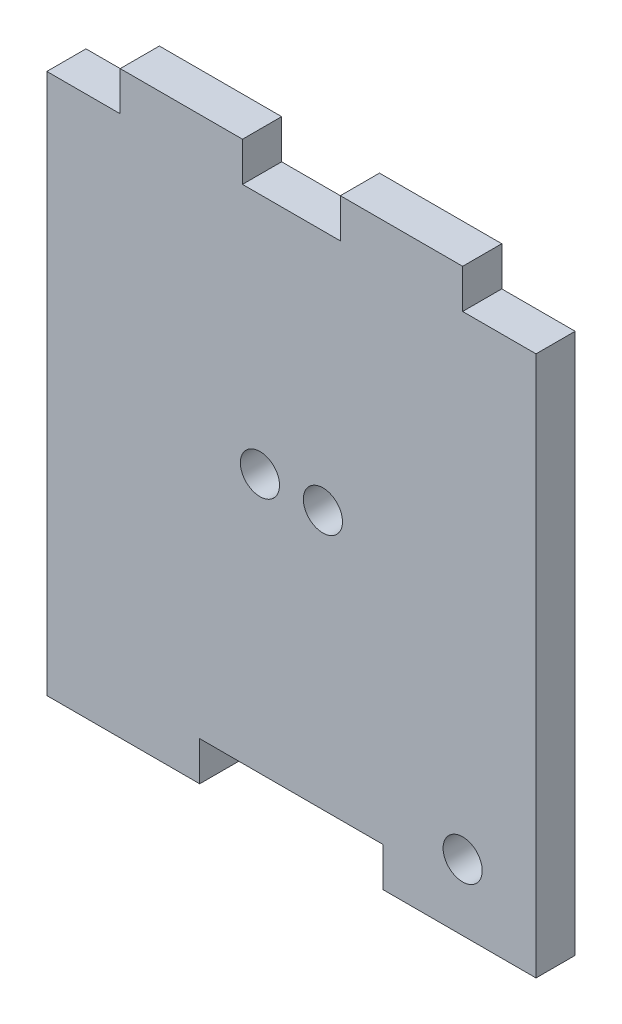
from build123d import *

# Parameters (mm, degrees)
SKETCH1_W           = 50
SKETCH1_H           = 16
SKETCH1_R           = 8
BOSS_EXTRUDE1_DEPTH = 16


with BuildPart() as part:
    # Sketch1 → Boss-Extrude1 (new body)
    # profile 1 of 6: a face of its own
    with BuildSketch(Plane.XY):
        with Locations((55, 229)):
            Rectangle(SKETCH1_W, SKETCH1_H)
    # profile 2 of 6: a face of its own
    with BuildSketch(Plane.XY):
        with Locations((145, 229)):
            Rectangle(SKETCH1_W, SKETCH1_H)
    # profile 3 of 6: a face of its own
    with BuildSketch(Plane.XY):
        Polygon((0, 221), (0, 0), (62.5, 0), (62.5, 16), (100, 16), (137.5, 16), (137.5, 0), (200, 0), (200, 221), (170, 221), (120, 221), (80, 221), (30, 221), align=None)
        with Locations((170, 27)):
            Circle(SKETCH1_R, mode=Mode.SUBTRACT)
        with Locations((87.13, 122)):
            Circle(SKETCH1_R, mode=Mode.SUBTRACT)
        with BuildLine():
            ThreePointArc((120.87, 122), (112.87, 114), (104.87, 122))
            ThreePointArc((104.87, 122), (112.87, 130), (120.87, 122))
        make_face(mode=Mode.SUBTRACT)
    # profile 4 of 6: a face of its own
    with BuildSketch(Plane.XY):
        Polygon((0, 221), (0, 0), (62.5, 0), (62.5, 16), (100, 16), (137.5, 16), (137.5, 0), (200, 0), (200, 221), (170, 221), (120, 221), (80, 221), (30, 221), align=None)
        with Locations((170, 27)):
            Circle(SKETCH1_R, mode=Mode.SUBTRACT)
        with Locations((87.13, 122)):
            Circle(SKETCH1_R, mode=Mode.SUBTRACT)
        with BuildLine():
            ThreePointArc((120.87, 122), (112.87, 114), (104.87, 122))
            ThreePointArc((104.87, 122), (112.87, 130), (120.87, 122))
        make_face(mode=Mode.SUBTRACT)
    # profile 5 of 6: a face of its own
    with BuildSketch(Plane.XY):
        Polygon((0, 221), (0, 0), (62.5, 0), (62.5, 16), (100, 16), (137.5, 16), (137.5, 0), (200, 0), (200, 221), (170, 221), (120, 221), (80, 221), (30, 221), align=None)
        with Locations((170, 27)):
            Circle(SKETCH1_R, mode=Mode.SUBTRACT)
        with Locations((87.13, 122)):
            Circle(SKETCH1_R, mode=Mode.SUBTRACT)
        with BuildLine():
            ThreePointArc((120.87, 122), (112.87, 114), (104.87, 122))
            ThreePointArc((104.87, 122), (112.87, 130), (120.87, 122))
        make_face(mode=Mode.SUBTRACT)
    # profile 6 of 6: a face of its own
    with BuildSketch(Plane.XY):
        Polygon((0, 221), (0, 0), (62.5, 0), (62.5, 16), (100, 16), (137.5, 16), (137.5, 0), (200, 0), (200, 221), (170, 221), (120, 221), (80, 221), (30, 221), align=None)
        with Locations((170, 27)):
            Circle(SKETCH1_R, mode=Mode.SUBTRACT)
        with Locations((87.13, 122)):
            Circle(SKETCH1_R, mode=Mode.SUBTRACT)
        with BuildLine():
            ThreePointArc((120.87, 122), (112.87, 114), (104.87, 122))
            ThreePointArc((104.87, 122), (112.87, 130), (120.87, 122))
        make_face(mode=Mode.SUBTRACT)
    extrude(amount=BOSS_EXTRUDE1_DEPTH)


solid = part.part
